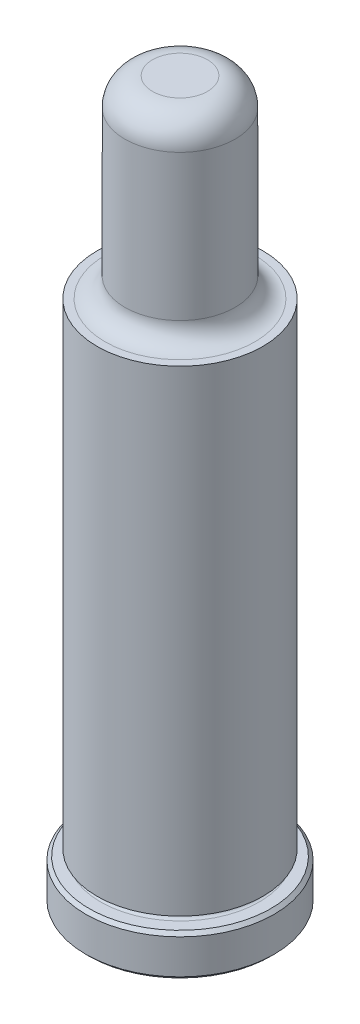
from build123d import *

# Parameters (mm, degrees)
FILLET6_R     = 3.175
CHAMFER1_SIZE = 0.381


with BuildPart() as part:
    # Sketch1 → Revolve1 (revolve)
    with BuildSketch(Plane(origin=(0, 0, 0), x_dir=(0, 0, -1), z_dir=(1, 0, 0)), mode=Mode.PRIVATE) as revolve1_sk:
        with BuildLine():
            Line((0, 0), (10.8331, 0))
            Line((10.8331, 0), (10.8331, 4.7498))
            Line((10.8331, 4.7498), (9.1313, 4.7498))
            ThreePointArc((9.1313, 4.7498), (8.7503, 5.1308), (9.1313, 5.5118))
            Line((9.1313, 5.5118), (9.5377, 5.5118))
            Line((9.5377, 5.5118), (9.5377, 60.325))
            Line((9.5377, 60.325), (8.6233, 60.325))
            ThreePointArc((8.6233, 60.325), (7.006853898, 60.994553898), (6.3373, 62.611))
            Line((6.3373, 62.611), (6.3373, 82.55))
            Line((6.3373, 82.55), (0, 82.55))
            Line((0, 82.55), (0, 0))
        make_face()
    revolve(revolve1_sk.sketch.rotate(Axis((0, 0, 0), (0, -1, 0)), 180), axis=Axis((0, 0, 0), (0, -1, 0)))

    # Fillet6
    fillet6_edges = [part.edges().sort_by_distance(p)[0] for p in [
        (0, 82.55, -6.3373),
    ]]
    fillet(fillet6_edges, radius=FILLET6_R)

    # Chamfer1
    chamfer1_edges = [part.edges().sort_by_distance(p)[0] for p in [
        (0, 4.7498, -10.8331),
        (0, 0, -10.8331),
    ]]
    chamfer(chamfer1_edges, length=CHAMFER1_SIZE)


solid = part.part
